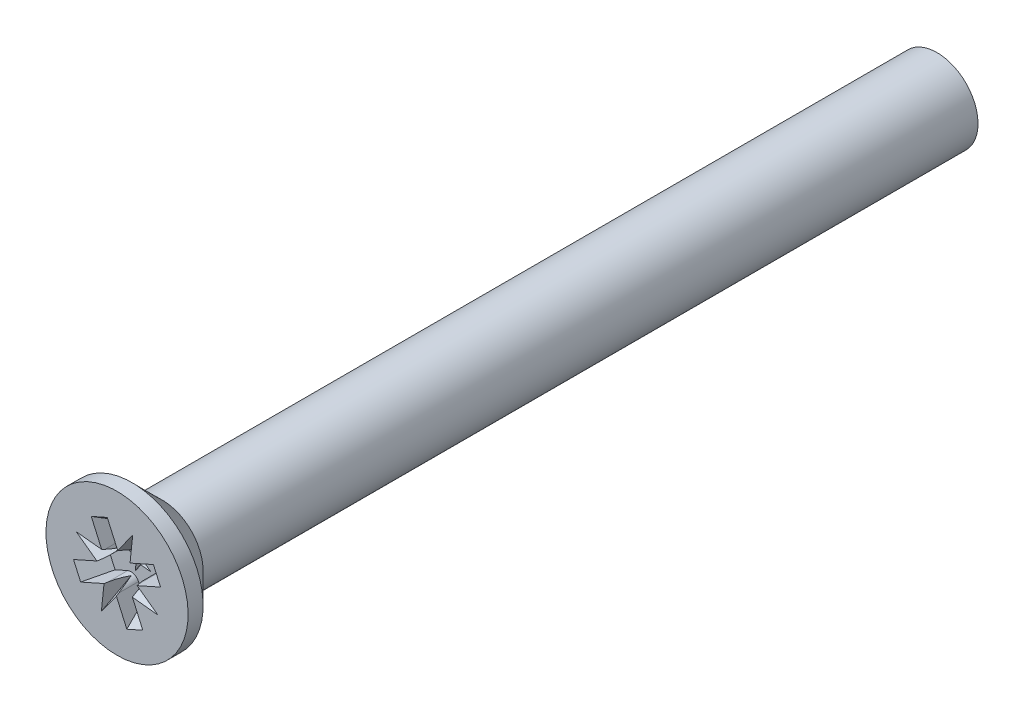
ISO-10303-21;
HEADER;
FILE_DESCRIPTION(('STEP AP214'),'2;1');
FILE_NAME('part.step','',(''),(''),'','','');
FILE_SCHEMA(('AUTOMOTIVE_DESIGN { 1 0 10303 214 1 1 1 1 }'));
ENDSEC;
DATA;
#1=APPLICATION_CONTEXT('core data for automotive mechanical design processes');
#2=APPLICATION_PROTOCOL_DEFINITION('international standard','automotive_design',2000,#1);
#3=PRODUCT_CONTEXT('',#1,'mechanical');
#4=PRODUCT('Part','Part','',(#3));
#5=PRODUCT_RELATED_PRODUCT_CATEGORY('part','',(#4));
#6=PRODUCT_DEFINITION_FORMATION('','',#4);
#7=PRODUCT_DEFINITION_CONTEXT('part definition',#1,'design');
#8=PRODUCT_DEFINITION('design','',#6,#7);
#9=PRODUCT_DEFINITION_SHAPE('','',#8);
#10=(LENGTH_UNIT() NAMED_UNIT(*) SI_UNIT(.MILLI.,.METRE.));
#11=(NAMED_UNIT(*) PLANE_ANGLE_UNIT() SI_UNIT($,.RADIAN.));
#12=(NAMED_UNIT(*) SI_UNIT($,.STERADIAN.) SOLID_ANGLE_UNIT());
#13=UNCERTAINTY_MEASURE_WITH_UNIT(LENGTH_MEASURE(1.E-05),#10,'distance_accuracy_value','');
#14=(GEOMETRIC_REPRESENTATION_CONTEXT(3) GLOBAL_UNCERTAINTY_ASSIGNED_CONTEXT((#13)) GLOBAL_UNIT_ASSIGNED_CONTEXT((#10,
#11,#12)) REPRESENTATION_CONTEXT('',''));
#15=CARTESIAN_POINT('',(0.,0.,0.));
#16=DIRECTION('',(0.,0.,1.));
#17=DIRECTION('',(1.,0.,0.));
#18=AXIS2_PLACEMENT_3D('',#15,#16,#17);
#19=CARTESIAN_POINT('',(0.702252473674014,-13.2440851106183,67.95));
#20=DIRECTION('',(-0.934548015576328,0.0981948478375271,-0.34202014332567));
#21=DIRECTION('',(-0.343681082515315,0.,0.939086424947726));
#22=AXIS2_PLACEMENT_3D('',#19,#20,#21);
#23=PLANE('',#22);
#24=DIRECTION('',(-0.353947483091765,-0.157601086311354,0.921891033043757));
#25=VECTOR('',#24,1.);
#26=CARTESIAN_POINT('',(1.13907958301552,-13.0495804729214,66.8122408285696));
#27=LINE('',#26,#25);
#28=CARTESIAN_POINT('',(1.13907958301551,-13.0495804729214,66.8122408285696));
#29=VERTEX_POINT('',#28);
#30=CARTESIAN_POINT('',(1.0189999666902,-13.1030479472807,67.125));
#31=VERTEX_POINT('',#30);
#32=EDGE_CURVE('E210',#29,#31,#27,.T.);
#33=ORIENTED_EDGE('',*,*,#32,.T.);
#34=DIRECTION('',(-0.104496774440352,-0.994525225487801,0.));
#35=VECTOR('',#34,1.);
#36=CARTESIAN_POINT('',(1.0189999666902,-13.1030479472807,67.125));
#37=LINE('',#36,#35);
#38=CARTESIAN_POINT('',(0.981473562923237,-13.4601972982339,67.125));
#39=VERTEX_POINT('',#38);
#40=EDGE_CURVE('E431',#31,#39,#37,.T.);
#41=ORIENTED_EDGE('',*,*,#40,.T.);
#42=DIRECTION('',(0.292031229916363,0.760839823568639,-0.579517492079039));
#43=VECTOR('',#42,1.);
#44=CARTESIAN_POINT('',(0.98147356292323,-13.4601972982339,67.125));
#45=LINE('',#44,#43);
#46=EDGE_CURVE('E398',#39,#29,#45,.T.);
#47=ORIENTED_EDGE('',*,*,#46,.T.);
#48=EDGE_LOOP('',(#33,#41,#47));
#49=FACE_BOUND('',#48,.T.);
#50=ADVANCED_FACE('F17',(#49),#23,.F.);
#51=CARTESIAN_POINT('',(1.33358422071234,-13.4864075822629,67.95));
#52=DIRECTION('',(0.760244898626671,-0.552313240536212,-0.34202014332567));
#53=DIRECTION('',(0.587759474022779,0.809035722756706,0.));
#54=AXIS2_PLACEMENT_3D('',#51,#52,#53);
#55=PLANE('',#54);
#56=ORIENTED_EDGE('',*,*,#46,.F.);
#57=DIRECTION('',(0.587759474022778,0.809035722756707,0.));
#58=VECTOR('',#57,1.);
#59=CARTESIAN_POINT('',(0.981473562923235,-13.4601972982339,67.125));
#60=LINE('',#59,#58);
#61=CARTESIAN_POINT('',(1.19254705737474,-13.1696600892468,67.125));
#62=VERTEX_POINT('',#61);
#63=EDGE_CURVE('E501',#39,#62,#60,.T.);
#64=ORIENTED_EDGE('',*,*,#63,.T.);
#65=DIRECTION('',(-0.157601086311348,0.353947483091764,-0.921891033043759));
#66=VECTOR('',#65,1.);
#67=CARTESIAN_POINT('',(1.19254705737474,-13.1696600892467,67.125));
#68=LINE('',#67,#66);
#69=EDGE_CURVE('E395',#62,#29,#68,.T.);
#70=ORIENTED_EDGE('',*,*,#69,.T.);
#71=EDGE_LOOP('',(#56,#64,#70));
#72=FACE_BOUND('',#71,.T.);
#73=ADVANCED_FACE('F720',(#72),#55,.F.);
#74=CARTESIAN_POINT('',(1.33358422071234,-13.4864075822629,67.95));
#75=DIRECTION('',(-0.0981948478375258,-0.934548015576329,-0.34202014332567));
#76=DIRECTION('',(0.,0.343681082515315,-0.939086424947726));
#77=AXIS2_PLACEMENT_3D('',#74,#75,#76);
#78=PLANE('',#77);
#79=ORIENTED_EDGE('',*,*,#69,.F.);
#80=DIRECTION('',(0.994525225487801,-0.104496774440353,0.));
#81=VECTOR('',#80,1.);
#82=CARTESIAN_POINT('',(1.19254705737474,-13.1696600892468,67.125));
#83=LINE('',#82,#81);
#84=CARTESIAN_POINT('',(1.54969640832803,-13.2071864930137,67.125));
#85=VERTEX_POINT('',#84);
#86=EDGE_CURVE('E499',#62,#85,#83,.T.);
#87=ORIENTED_EDGE('',*,*,#86,.T.);
#88=DIRECTION('',(-0.760839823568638,0.292031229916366,-0.579517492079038));
#89=VECTOR('',#88,1.);
#90=CARTESIAN_POINT('',(1.54969640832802,-13.2071864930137,67.125));
#91=LINE('',#90,#89);
#92=EDGE_CURVE('E392',#85,#29,#91,.T.);
#93=ORIENTED_EDGE('',*,*,#92,.T.);
#94=EDGE_LOOP('',(#79,#87,#93));
#95=FACE_BOUND('',#94,.T.);
#96=ADVANCED_FACE('F724',(#95),#78,.F.);
#97=CARTESIAN_POINT('',(1.57590669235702,-12.8550758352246,67.95));
#98=DIRECTION('',(0.552313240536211,0.760244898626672,-0.34202014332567));
#99=DIRECTION('',(-0.809035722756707,0.587759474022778,0.));
#100=AXIS2_PLACEMENT_3D('',#97,#98,#99);
#101=PLANE('',#100);
#102=ORIENTED_EDGE('',*,*,#92,.F.);
#103=DIRECTION('',(-0.809035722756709,0.587759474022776,0.));
#104=VECTOR('',#103,1.);
#105=CARTESIAN_POINT('',(1.54969640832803,-13.2071864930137,67.125));
#106=LINE('',#105,#104);
#107=CARTESIAN_POINT('',(1.25915919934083,-12.9961129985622,67.125));
#108=VERTEX_POINT('',#107);
#109=EDGE_CURVE('E497',#85,#108,#106,.T.);
#110=ORIENTED_EDGE('',*,*,#109,.T.);
#111=DIRECTION('',(-0.353947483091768,-0.157601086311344,-0.921891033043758));
#112=VECTOR('',#111,1.);
#113=CARTESIAN_POINT('',(1.25915919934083,-12.9961129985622,67.125));
#114=LINE('',#113,#112);
#115=EDGE_CURVE('E389',#108,#29,#114,.T.);
#116=ORIENTED_EDGE('',*,*,#115,.T.);
#117=EDGE_LOOP('',(#102,#110,#116));
#118=FACE_BOUND('',#117,.T.);
#119=ADVANCED_FACE('F728',(#118),#101,.F.);
#120=CARTESIAN_POINT('',(1.57590669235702,-12.8550758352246,67.95));
#121=DIRECTION('',(0.934548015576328,-0.0981948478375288,-0.342020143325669));
#122=DIRECTION('',(-0.343681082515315,0.,-0.939086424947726));
#123=AXIS2_PLACEMENT_3D('',#120,#121,#122);
#124=PLANE('',#123);
#125=ORIENTED_EDGE('',*,*,#115,.F.);
#126=DIRECTION('',(0.104496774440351,0.994525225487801,0.));
#127=VECTOR('',#126,1.);
#128=CARTESIAN_POINT('',(1.25915919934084,-12.9961129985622,67.125));
#129=LINE('',#128,#127);
#130=CARTESIAN_POINT('',(1.2966856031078,-12.6389636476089,67.125));
#131=VERTEX_POINT('',#130);
#132=EDGE_CURVE('E495',#108,#131,#129,.T.);
#133=ORIENTED_EDGE('',*,*,#132,.T.);
#134=DIRECTION('',(-0.292031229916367,-0.760839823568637,-0.57951749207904));
#135=VECTOR('',#134,1.);
#136=CARTESIAN_POINT('',(1.2966856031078,-12.6389636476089,67.125));
#137=LINE('',#136,#135);
#138=EDGE_CURVE('E386',#131,#29,#137,.T.);
#139=ORIENTED_EDGE('',*,*,#138,.T.);
#140=EDGE_LOOP('',(#125,#133,#139));
#141=FACE_BOUND('',#140,.T.);
#142=ADVANCED_FACE('F731',(#141),#124,.F.);
#143=CARTESIAN_POINT('',(0.944574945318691,-12.6127533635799,67.95));
#144=DIRECTION('',(-0.76024489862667,0.552313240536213,-0.342020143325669));
#145=DIRECTION('',(-0.58775947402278,-0.809035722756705,0.));
#146=AXIS2_PLACEMENT_3D('',#143,#144,#145);
#147=PLANE('',#146);
#148=ORIENTED_EDGE('',*,*,#138,.F.);
#149=DIRECTION('',(-0.587759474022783,-0.809035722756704,0.));
#150=VECTOR('',#149,1.);
#151=CARTESIAN_POINT('',(1.2966856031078,-12.6389636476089,67.125));
#152=LINE('',#151,#150);
#153=CARTESIAN_POINT('',(1.0856121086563,-12.9295008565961,67.125));
#154=VERTEX_POINT('',#153);
#155=EDGE_CURVE('E493',#131,#154,#152,.T.);
#156=ORIENTED_EDGE('',*,*,#155,.T.);
#157=DIRECTION('',(0.157601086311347,-0.353947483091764,-0.921891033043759));
#158=VECTOR('',#157,1.);
#159=CARTESIAN_POINT('',(1.08561210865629,-12.9295008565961,67.125));
#160=LINE('',#159,#158);
#161=EDGE_CURVE('E383',#154,#29,#160,.T.);
#162=ORIENTED_EDGE('',*,*,#161,.T.);
#163=EDGE_LOOP('',(#148,#156,#162));
#164=FACE_BOUND('',#163,.T.);
#165=ADVANCED_FACE('F733',(#164),#147,.F.);
#166=CARTESIAN_POINT('',(0.944574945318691,-12.6127533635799,67.95));
#167=DIRECTION('',(0.0981948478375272,0.934548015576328,-0.34202014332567));
#168=DIRECTION('',(0.,0.343681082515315,0.939086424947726));
#169=AXIS2_PLACEMENT_3D('',#166,#167,#168);
#170=PLANE('',#169);
#171=ORIENTED_EDGE('',*,*,#161,.F.);
#172=DIRECTION('',(-0.994525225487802,0.104496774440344,0.));
#173=VECTOR('',#172,1.);
#174=CARTESIAN_POINT('',(1.08561210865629,-12.9295008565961,67.125));
#175=LINE('',#174,#173);
#176=CARTESIAN_POINT('',(0.728462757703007,-12.8919744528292,67.125));
#177=VERTEX_POINT('',#176);
#178=EDGE_CURVE('E491',#154,#177,#175,.T.);
#179=ORIENTED_EDGE('',*,*,#178,.T.);
#180=DIRECTION('',(0.760839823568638,-0.292031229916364,-0.579517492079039));
#181=VECTOR('',#180,1.);
#182=CARTESIAN_POINT('',(0.728462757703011,-12.8919744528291,67.125));
#183=LINE('',#182,#181);
#184=EDGE_CURVE('E380',#177,#29,#183,.T.);
#185=ORIENTED_EDGE('',*,*,#184,.T.);
#186=EDGE_LOOP('',(#171,#179,#185));
#187=FACE_BOUND('',#186,.T.);
#188=ADVANCED_FACE('F712',(#187),#170,.F.);
#189=CARTESIAN_POINT('',(0.702252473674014,-13.2440851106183,67.95));
#190=DIRECTION('',(-0.552313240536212,-0.760244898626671,-0.34202014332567));
#191=DIRECTION('',(0.809035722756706,-0.587759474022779,0.));
#192=AXIS2_PLACEMENT_3D('',#189,#190,#191);
#193=PLANE('',#192);
#194=ORIENTED_EDGE('',*,*,#184,.F.);
#195=DIRECTION('',(0.809035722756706,-0.58775947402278,0.));
#196=VECTOR('',#195,1.);
#197=CARTESIAN_POINT('',(0.728462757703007,-12.8919744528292,67.125));
#198=LINE('',#197,#196);
#199=EDGE_CURVE('E429',#177,#31,#198,.T.);
#200=ORIENTED_EDGE('',*,*,#199,.T.);
#201=ORIENTED_EDGE('',*,*,#32,.F.);
#202=EDGE_LOOP('',(#194,#200,#201));
#203=FACE_BOUND('',#202,.T.);
#204=ADVANCED_FACE('F625',(#203),#193,.F.);
#205=CARTESIAN_POINT('',(0.320494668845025,-12.7353850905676,67.125));
#206=DIRECTION('',(0.,0.,-1.));
#207=DIRECTION('',(0.,1.,0.));
#208=AXIS2_PLACEMENT_3D('',#205,#206,#207);
#209=CYLINDRICAL_SURFACE('',#208,0.3);
#210=CARTESIAN_POINT('',(0.320494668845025,-12.7353850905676,67.4357416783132));
#211=DIRECTION('',(-0.552313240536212,-0.760244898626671,-0.34202014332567));
#212=DIRECTION('',(0.201025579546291,0.276706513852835,-0.939692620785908));
#213=AXIS2_PLACEMENT_3D('',#210,#211,#212);
#214=ELLIPSE('',#213,0.877141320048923,0.3);
#215=CARTESIAN_POINT('',(0.600572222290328,-12.8428865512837,67.22241183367));
#216=VERTEX_POINT('',#215);
#217=CARTESIAN_POINT('',(0.442524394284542,-13.0094448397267,67.8478632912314));
#218=VERTEX_POINT('',#217);
#219=EDGE_CURVE('E342',#216,#218,#214,.T.);
#220=ORIENTED_EDGE('',*,*,#219,.T.);
#221=DIRECTION('',(0.,0.,1.));
#222=VECTOR('',#221,1.);
#223=CARTESIAN_POINT('',(0.442524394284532,-13.0094448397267,67.125));
#224=LINE('',#223,#222);
#225=CARTESIAN_POINT('',(0.442524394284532,-13.0094448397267,67.125));
#226=VERTEX_POINT('',#225);
#227=EDGE_CURVE('E339',#226,#218,#224,.T.);
#228=ORIENTED_EDGE('',*,*,#227,.F.);
#229=CARTESIAN_POINT('',(0.320494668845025,-12.7353850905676,67.125));
#230=DIRECTION('',(0.,0.,-1.));
#231=DIRECTION('',(0.,1.,0.));
#232=AXIS2_PLACEMENT_3D('',#229,#230,#231);
#233=CIRCLE('',#232,0.3);
#234=CARTESIAN_POINT('',(0.594554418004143,-12.6133553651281,67.125));
#235=VERTEX_POINT('',#234);
#236=EDGE_CURVE('E209',#226,#235,#233,.F.);
#237=ORIENTED_EDGE('',*,*,#236,.T.);
#238=DIRECTION('',(0.,0.,1.));
#239=VECTOR('',#238,1.);
#240=CARTESIAN_POINT('',(0.594554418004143,-12.6133553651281,67.125));
#241=LINE('',#240,#239);
#242=CARTESIAN_POINT('',(0.594554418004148,-12.6133553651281,67.8478632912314));
#243=VERTEX_POINT('',#242);
#244=EDGE_CURVE('E299',#243,#235,#241,.F.);
#245=ORIENTED_EDGE('',*,*,#244,.F.);
#246=CARTESIAN_POINT('',(0.320494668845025,-12.7353850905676,67.4357416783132));
#247=DIRECTION('',(0.0981948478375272,0.934548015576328,-0.34202014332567));
#248=DIRECTION('',(-0.035740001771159,-0.340147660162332,-0.939692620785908));
#249=AXIS2_PLACEMENT_3D('',#246,#247,#248);
#250=ELLIPSE('',#249,0.877141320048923,0.3);
#251=EDGE_CURVE('E423',#243,#216,#250,.T.);
#252=ORIENTED_EDGE('',*,*,#251,.T.);
#253=EDGE_LOOP('',(#220,#228,#237,#245,#252));
#254=FACE_BOUND('',#253,.T.);
#255=ADVANCED_FACE('F436',(#254),#209,.T.);
#256=CARTESIAN_POINT('',(1.45327496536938,-12.2309955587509,67.125));
#257=DIRECTION('',(0.,0.,-1.));
#258=DIRECTION('',(0.,1.,0.));
#259=AXIS2_PLACEMENT_3D('',#256,#257,#258);
#260=CYLINDRICAL_SURFACE('',#259,0.3);
#261=CARTESIAN_POINT('',(1.45327496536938,-12.2309955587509,67.4357416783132));
#262=DIRECTION('',(-0.76024489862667,0.552313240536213,-0.342020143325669));
#263=DIRECTION('',(0.276706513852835,-0.201025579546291,-0.939692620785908));
#264=AXIS2_PLACEMENT_3D('',#261,#262,#263);
#265=ELLIPSE('',#264,0.877141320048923,0.3);
#266=CARTESIAN_POINT('',(1.34577350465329,-12.5110731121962,67.22241183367));
#267=VERTEX_POINT('',#266);
#268=CARTESIAN_POINT('',(1.17921521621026,-12.3530252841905,67.8478632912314));
#269=VERTEX_POINT('',#268);
#270=EDGE_CURVE('E280',#267,#269,#265,.T.);
#271=ORIENTED_EDGE('',*,*,#270,.T.);
#272=DIRECTION('',(0.,0.,1.));
#273=VECTOR('',#272,1.);
#274=CARTESIAN_POINT('',(1.17921521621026,-12.3530252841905,67.125));
#275=LINE('',#274,#273);
#276=CARTESIAN_POINT('',(1.17921521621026,-12.3530252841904,67.125));
#277=VERTEX_POINT('',#276);
#278=EDGE_CURVE('E277',#277,#269,#275,.T.);
#279=ORIENTED_EDGE('',*,*,#278,.F.);
#280=CARTESIAN_POINT('',(1.45327496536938,-12.2309955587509,67.125));
#281=DIRECTION('',(0.,0.,-1.));
#282=DIRECTION('',(0.,1.,0.));
#283=AXIS2_PLACEMENT_3D('',#280,#281,#282);
#284=CIRCLE('',#283,0.3);
#285=CARTESIAN_POINT('',(1.57530469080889,-12.5050553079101,67.125));
#286=VERTEX_POINT('',#285);
#287=EDGE_CURVE('E430',#277,#286,#284,.F.);
#288=ORIENTED_EDGE('',*,*,#287,.T.);
#289=DIRECTION('',(0.,0.,1.));
#290=VECTOR('',#289,1.);
#291=CARTESIAN_POINT('',(1.57530469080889,-12.5050553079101,67.125));
#292=LINE('',#291,#290);
#293=CARTESIAN_POINT('',(1.57530469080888,-12.5050553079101,67.8478632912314));
#294=VERTEX_POINT('',#293);
#295=EDGE_CURVE('E235',#294,#286,#292,.F.);
#296=ORIENTED_EDGE('',*,*,#295,.F.);
#297=CARTESIAN_POINT('',(1.45327496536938,-12.2309955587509,67.4357416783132));
#298=DIRECTION('',(0.934548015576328,-0.0981948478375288,-0.342020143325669));
#299=DIRECTION('',(-0.340147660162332,0.0357400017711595,-0.939692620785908));
#300=AXIS2_PLACEMENT_3D('',#297,#298,#299);
#301=ELLIPSE('',#300,0.877141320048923,0.3);
#302=EDGE_CURVE('E419',#294,#267,#301,.T.);
#303=ORIENTED_EDGE('',*,*,#302,.T.);
#304=EDGE_LOOP('',(#271,#279,#288,#296,#303));
#305=FACE_BOUND('',#304,.T.);
#306=ADVANCED_FACE('F616',(#305),#260,.T.);
#307=CARTESIAN_POINT('',(1.95766449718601,-13.3637758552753,67.125));
#308=DIRECTION('',(0.,0.,-1.));
#309=DIRECTION('',(0.,1.,0.));
#310=AXIS2_PLACEMENT_3D('',#307,#308,#309);
#311=CYLINDRICAL_SURFACE('',#310,0.3);
#312=CARTESIAN_POINT('',(1.95766449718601,-13.3637758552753,67.4357416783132));
#313=DIRECTION('',(0.552313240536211,0.760244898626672,-0.34202014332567));
#314=DIRECTION('',(-0.201025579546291,-0.276706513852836,-0.939692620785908));
#315=AXIS2_PLACEMENT_3D('',#312,#313,#314);
#316=ELLIPSE('',#315,0.877141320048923,0.3);
#317=CARTESIAN_POINT('',(1.67758694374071,-13.2562743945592,67.22241183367));
#318=VERTEX_POINT('',#317);
#319=CARTESIAN_POINT('',(1.8356347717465,-13.0897161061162,67.8478632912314));
#320=VERTEX_POINT('',#319);
#321=EDGE_CURVE('E215',#318,#320,#316,.T.);
#322=ORIENTED_EDGE('',*,*,#321,.T.);
#323=DIRECTION('',(0.,0.,1.));
#324=VECTOR('',#323,1.);
#325=CARTESIAN_POINT('',(1.8356347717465,-13.0897161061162,67.125));
#326=LINE('',#325,#324);
#327=CARTESIAN_POINT('',(1.8356347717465,-13.0897161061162,67.125));
#328=VERTEX_POINT('',#327);
#329=EDGE_CURVE('E212',#328,#320,#326,.T.);
#330=ORIENTED_EDGE('',*,*,#329,.F.);
#331=CARTESIAN_POINT('',(1.95766449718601,-13.3637758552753,67.125));
#332=DIRECTION('',(0.,0.,-1.));
#333=DIRECTION('',(0.,1.,0.));
#334=AXIS2_PLACEMENT_3D('',#331,#332,#333);
#335=CIRCLE('',#334,0.3);
#336=CARTESIAN_POINT('',(1.68360474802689,-13.4858055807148,67.125));
#337=VERTEX_POINT('',#336);
#338=EDGE_CURVE('E20',#328,#337,#335,.F.);
#339=ORIENTED_EDGE('',*,*,#338,.T.);
#340=DIRECTION('',(0.,0.,1.));
#341=VECTOR('',#340,1.);
#342=CARTESIAN_POINT('',(1.68360474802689,-13.4858055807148,67.125));
#343=LINE('',#342,#341);
#344=CARTESIAN_POINT('',(1.68360474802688,-13.4858055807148,67.8478632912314));
#345=VERTEX_POINT('',#344);
#346=EDGE_CURVE('E511',#345,#337,#343,.F.);
#347=ORIENTED_EDGE('',*,*,#346,.F.);
#348=CARTESIAN_POINT('',(1.95766449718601,-13.3637758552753,67.4357416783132));
#349=DIRECTION('',(-0.0981948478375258,-0.934548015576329,-0.34202014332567));
#350=DIRECTION('',(0.0357400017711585,0.340147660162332,-0.939692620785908));
#351=AXIS2_PLACEMENT_3D('',#348,#349,#350);
#352=ELLIPSE('',#351,0.877141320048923,0.3);
#353=EDGE_CURVE('E414',#345,#318,#352,.T.);
#354=ORIENTED_EDGE('',*,*,#353,.T.);
#355=EDGE_LOOP('',(#322,#330,#339,#347,#354));
#356=FACE_BOUND('',#355,.T.);
#357=ADVANCED_FACE('F213',(#356),#311,.T.);
#358=CARTESIAN_POINT('',(1.30124494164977,-12.6270850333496,67.125));
#359=DIRECTION('',(0.,0.,-1.));
#360=DIRECTION('',(0.,1.,0.));
#361=AXIS2_PLACEMENT_3D('',#358,#359,#360);
#362=PLANE('',#361);
#363=ORIENTED_EDGE('',*,*,#178,.F.);
#364=ORIENTED_EDGE('',*,*,#155,.F.);
#365=ORIENTED_EDGE('',*,*,#132,.F.);
#366=ORIENTED_EDGE('',*,*,#109,.F.);
#367=ORIENTED_EDGE('',*,*,#86,.F.);
#368=ORIENTED_EDGE('',*,*,#63,.F.);
#369=ORIENTED_EDGE('',*,*,#40,.F.);
#370=ORIENTED_EDGE('',*,*,#199,.F.);
#371=EDGE_LOOP('',(#363,#364,#365,#366,#367,#368,#369,#370));
#372=FACE_BOUND('',#371,.T.);
#373=DIRECTION('',(0.406765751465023,-0.913532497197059,0.));
#374=VECTOR('',#373,1.);
#375=CARTESIAN_POINT('',(1.30124494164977,-12.6270850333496,67.125));
#376=LINE('',#375,#374);
#377=CARTESIAN_POINT('',(0.974332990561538,-11.8928917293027,67.125));
#378=VERTEX_POINT('',#377);
#379=EDGE_CURVE('E281',#378,#277,#376,.T.);
#380=ORIENTED_EDGE('',*,*,#379,.F.);
#381=DIRECTION('',(0.913532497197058,0.406765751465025,0.));
#382=VECTOR('',#381,1.);
#383=CARTESIAN_POINT('',(0.389672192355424,-12.1532218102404,67.125));
#384=LINE('',#383,#382);
#385=CARTESIAN_POINT('',(0.389672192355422,-12.1532218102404,67.125));
#386=VERTEX_POINT('',#385);
#387=EDGE_CURVE('E297',#386,#378,#384,.T.);
#388=ORIENTED_EDGE('',*,*,#387,.F.);
#389=DIRECTION('',(-0.406765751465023,0.913532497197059,0.));
#390=VECTOR('',#389,1.);
#391=CARTESIAN_POINT('',(0.71658414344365,-12.8874151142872,67.125));
#392=LINE('',#391,#390);
#393=EDGE_CURVE('E307',#235,#386,#392,.T.);
#394=ORIENTED_EDGE('',*,*,#393,.F.);
#395=ORIENTED_EDGE('',*,*,#236,.F.);
#396=DIRECTION('',(0.913532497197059,0.406765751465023,0.));
#397=VECTOR('',#396,1.);
#398=CARTESIAN_POINT('',(0.71658414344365,-12.8874151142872,67.125));
#399=LINE('',#398,#397);
#400=CARTESIAN_POINT('',(-0.0176091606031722,-13.2143270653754,67.125));
#401=VERTEX_POINT('',#400);
#402=EDGE_CURVE('E343',#401,#226,#399,.T.);
#403=ORIENTED_EDGE('',*,*,#402,.F.);
#404=DIRECTION('',(-0.406765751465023,0.913532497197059,0.));
#405=VECTOR('',#404,1.);
#406=CARTESIAN_POINT('',(0.242720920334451,-13.7989878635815,67.125));
#407=LINE('',#406,#405);
#408=CARTESIAN_POINT('',(0.24272092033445,-13.7989878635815,67.125));
#409=VERTEX_POINT('',#408);
#410=EDGE_CURVE('E359',#409,#401,#407,.T.);
#411=ORIENTED_EDGE('',*,*,#410,.F.);
#412=DIRECTION('',(-0.913532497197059,-0.406765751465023,0.));
#413=VECTOR('',#412,1.);
#414=CARTESIAN_POINT('',(0.976914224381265,-13.4720759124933,67.125));
#415=LINE('',#414,#413);
#416=CARTESIAN_POINT('',(0.702854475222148,-13.5941056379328,67.125));
#417=VERTEX_POINT('',#416);
#418=EDGE_CURVE('E369',#417,#409,#415,.T.);
#419=ORIENTED_EDGE('',*,*,#418,.F.);
#420=CARTESIAN_POINT('',(0.824884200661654,-13.8681653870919,67.125));
#421=DIRECTION('',(0.,0.,-1.));
#422=DIRECTION('',(0.,1.,0.));
#423=AXIS2_PLACEMENT_3D('',#420,#421,#422);
#424=CIRCLE('',#423,0.3);
#425=CARTESIAN_POINT('',(1.09894394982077,-13.7461356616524,67.125));
#426=VERTEX_POINT('',#425);
#427=EDGE_CURVE('E372',#426,#417,#424,.F.);
#428=ORIENTED_EDGE('',*,*,#427,.F.);
#429=DIRECTION('',(-0.406765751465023,0.913532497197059,0.));
#430=VECTOR('',#429,1.);
#431=CARTESIAN_POINT('',(0.976914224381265,-13.4720759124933,67.125));
#432=LINE('',#431,#430);
#433=CARTESIAN_POINT('',(1.30382617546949,-14.2062692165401,67.125));
#434=VERTEX_POINT('',#433);
#435=EDGE_CURVE('E478',#434,#426,#432,.T.);
#436=ORIENTED_EDGE('',*,*,#435,.F.);
#437=DIRECTION('',(-0.913532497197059,-0.406765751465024,0.));
#438=VECTOR('',#437,1.);
#439=CARTESIAN_POINT('',(1.88848697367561,-13.9459391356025,67.125));
#440=LINE('',#439,#438);
#441=CARTESIAN_POINT('',(1.88848697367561,-13.9459391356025,67.125));
#442=VERTEX_POINT('',#441);
#443=EDGE_CURVE('E509',#442,#434,#440,.T.);
#444=ORIENTED_EDGE('',*,*,#443,.F.);
#445=DIRECTION('',(0.406765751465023,-0.913532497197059,0.));
#446=VECTOR('',#445,1.);
#447=CARTESIAN_POINT('',(1.56157502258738,-13.2117458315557,67.125));
#448=LINE('',#447,#446);
#449=EDGE_CURVE('E205',#337,#442,#448,.T.);
#450=ORIENTED_EDGE('',*,*,#449,.F.);
#451=ORIENTED_EDGE('',*,*,#338,.F.);
#452=DIRECTION('',(-0.913532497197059,-0.406765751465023,0.));
#453=VECTOR('',#452,1.);
#454=CARTESIAN_POINT('',(1.56157502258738,-13.2117458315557,67.125));
#455=LINE('',#454,#453);
#456=CARTESIAN_POINT('',(2.2957683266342,-12.8848338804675,67.125));
#457=VERTEX_POINT('',#456);
#458=EDGE_CURVE('E202',#457,#328,#455,.T.);
#459=ORIENTED_EDGE('',*,*,#458,.F.);
#460=DIRECTION('',(0.406765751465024,-0.913532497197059,0.));
#461=VECTOR('',#460,1.);
#462=CARTESIAN_POINT('',(2.03543824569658,-12.3001730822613,67.125));
#463=LINE('',#462,#461);
#464=CARTESIAN_POINT('',(2.03543824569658,-12.3001730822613,67.125));
#465=VERTEX_POINT('',#464);
#466=EDGE_CURVE('E233',#465,#457,#463,.T.);
#467=ORIENTED_EDGE('',*,*,#466,.F.);
#468=DIRECTION('',(0.913532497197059,0.406765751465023,0.));
#469=VECTOR('',#468,1.);
#470=CARTESIAN_POINT('',(1.30124494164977,-12.6270850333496,67.125));
#471=LINE('',#470,#469);
#472=EDGE_CURVE('E245',#286,#465,#471,.T.);
#473=ORIENTED_EDGE('',*,*,#472,.F.);
#474=ORIENTED_EDGE('',*,*,#287,.F.);
#475=EDGE_LOOP('',(#380,#388,#394,#395,#403,#411,#419,#428,#436,#444,#450,#451,#459,#467,#473,#474));
#476=FACE_BOUND('',#475,.T.);
#477=ADVANCED_FACE('F200',(#372,#476),#362,.F.);
#478=CARTESIAN_POINT('',(0.824884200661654,-13.8681653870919,67.125));
#479=DIRECTION('',(0.,0.,-1.));
#480=DIRECTION('',(0.,1.,0.));
#481=AXIS2_PLACEMENT_3D('',#478,#479,#480);
#482=CYLINDRICAL_SURFACE('',#481,0.3);
#483=CARTESIAN_POINT('',(0.824884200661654,-13.8681653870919,67.4357416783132));
#484=DIRECTION('',(-0.934548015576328,0.0981948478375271,-0.34202014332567));
#485=DIRECTION('',(0.340147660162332,-0.0357400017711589,-0.939692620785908));
#486=AXIS2_PLACEMENT_3D('',#483,#484,#485);
#487=ELLIPSE('',#486,0.877141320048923,0.3);
#488=CARTESIAN_POINT('',(0.702854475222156,-13.5941056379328,67.8478632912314));
#489=VERTEX_POINT('',#488);
#490=CARTESIAN_POINT('',(0.932385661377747,-13.5880878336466,67.22241183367));
#491=VERTEX_POINT('',#490);
#492=EDGE_CURVE('E407',#489,#491,#487,.T.);
#493=ORIENTED_EDGE('',*,*,#492,.T.);
#494=CARTESIAN_POINT('',(0.824884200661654,-13.8681653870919,67.4357416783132));
#495=DIRECTION('',(0.760244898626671,-0.552313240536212,-0.34202014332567));
#496=DIRECTION('',(-0.276706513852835,0.201025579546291,-0.939692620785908));
#497=AXIS2_PLACEMENT_3D('',#494,#495,#496);
#498=ELLIPSE('',#497,0.877141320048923,0.3);
#499=CARTESIAN_POINT('',(1.09894394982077,-13.7461356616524,67.8478632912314));
#500=VERTEX_POINT('',#499);
#501=EDGE_CURVE('E410',#491,#500,#498,.T.);
#502=ORIENTED_EDGE('',*,*,#501,.T.);
#503=DIRECTION('',(0.,0.,1.));
#504=VECTOR('',#503,1.);
#505=CARTESIAN_POINT('',(1.09894394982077,-13.7461356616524,67.125));
#506=LINE('',#505,#504);
#507=EDGE_CURVE('E413',#426,#500,#506,.T.);
#508=ORIENTED_EDGE('',*,*,#507,.F.);
#509=ORIENTED_EDGE('',*,*,#427,.T.);
#510=DIRECTION('',(0.,0.,1.));
#511=VECTOR('',#510,1.);
#512=CARTESIAN_POINT('',(0.702854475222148,-13.5941056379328,67.125));
#513=LINE('',#512,#511);
#514=EDGE_CURVE('E361',#489,#417,#513,.F.);
#515=ORIENTED_EDGE('',*,*,#514,.F.);
#516=EDGE_LOOP('',(#493,#502,#508,#509,#515));
#517=FACE_BOUND('',#516,.T.);
#518=ADVANCED_FACE('F695',(#517),#482,.T.);
#519=CARTESIAN_POINT('',(0.976914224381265,-13.4720759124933,67.125));
#520=DIRECTION('',(-0.406765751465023,0.913532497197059,0.));
#521=DIRECTION('',(-0.913532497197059,-0.406765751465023,0.));
#522=AXIS2_PLACEMENT_3D('',#519,#520,#521);
#523=PLANE('',#522);
#524=DIRECTION('',(0.353947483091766,0.157601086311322,-0.921891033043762));
#525=VECTOR('',#524,1.);
#526=CARTESIAN_POINT('',(0.66364047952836,-13.6115663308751,67.95));
#527=LINE('',#526,#525);
#528=CARTESIAN_POINT('',(0.66364047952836,-13.6115663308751,67.95));
#529=VERTEX_POINT('',#528);
#530=EDGE_CURVE('E409',#529,#489,#527,.T.);
#531=ORIENTED_EDGE('',*,*,#530,.T.);
#532=ORIENTED_EDGE('',*,*,#514,.T.);
#533=ORIENTED_EDGE('',*,*,#418,.T.);
#534=DIRECTION('',(0.456766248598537,0.203382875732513,-0.866025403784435));
#535=VECTOR('',#534,1.);
#536=CARTESIAN_POINT('',(-0.192407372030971,-13.9927360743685,67.95));
#537=LINE('',#536,#535);
#538=CARTESIAN_POINT('',(-0.19240737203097,-13.9927360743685,67.95));
#539=VERTEX_POINT('',#538);
#540=EDGE_CURVE('E356',#539,#409,#537,.T.);
#541=ORIENTED_EDGE('',*,*,#540,.F.);
#542=DIRECTION('',(-0.913532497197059,-0.406765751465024,0.));
#543=VECTOR('',#542,1.);
#544=CARTESIAN_POINT('',(0.66364047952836,-13.6115663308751,67.95));
#545=LINE('',#544,#543);
#546=EDGE_CURVE('E366',#529,#539,#545,.T.);
#547=ORIENTED_EDGE('',*,*,#546,.F.);
#548=EDGE_LOOP('',(#531,#532,#533,#541,#547));
#549=FACE_BOUND('',#548,.T.);
#550=ADVANCED_FACE('F691',(#549),#523,.T.);
#551=CARTESIAN_POINT('',(-0.452737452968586,-13.4080752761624,67.95));
#552=DIRECTION('',(0.791142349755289,0.352269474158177,0.500000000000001));
#553=DIRECTION('',(0.534245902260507,0.,-0.845329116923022));
#554=AXIS2_PLACEMENT_3D('',#551,#552,#553);
#555=PLANE('',#554);
#556=DIRECTION('',(-0.406765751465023,0.913532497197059,0.));
#557=VECTOR('',#556,1.);
#558=CARTESIAN_POINT('',(-0.192407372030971,-13.9927360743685,67.95));
#559=LINE('',#558,#557);
#560=CARTESIAN_POINT('',(-0.452737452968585,-13.4080752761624,67.95));
#561=VERTEX_POINT('',#560);
#562=EDGE_CURVE('E346',#539,#561,#559,.T.);
#563=ORIENTED_EDGE('',*,*,#562,.F.);
#564=ORIENTED_EDGE('',*,*,#540,.T.);
#565=ORIENTED_EDGE('',*,*,#410,.T.);
#566=DIRECTION('',(0.456766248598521,0.203382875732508,-0.866025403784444));
#567=VECTOR('',#566,1.);
#568=CARTESIAN_POINT('',(-0.452737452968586,-13.4080752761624,67.95));
#569=LINE('',#568,#567);
#570=EDGE_CURVE('E351',#561,#401,#569,.T.);
#571=ORIENTED_EDGE('',*,*,#570,.F.);
#572=EDGE_LOOP('',(#563,#564,#565,#571));
#573=FACE_BOUND('',#572,.T.);
#574=ADVANCED_FACE('F688',(#573),#555,.T.);
#575=CARTESIAN_POINT('',(0.71658414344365,-12.8874151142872,67.125));
#576=DIRECTION('',(0.406765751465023,-0.913532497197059,0.));
#577=DIRECTION('',(0.913532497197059,0.406765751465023,0.));
#578=AXIS2_PLACEMENT_3D('',#575,#576,#577);
#579=PLANE('',#578);
#580=DIRECTION('',(-0.353947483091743,-0.157601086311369,0.921891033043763));
#581=VECTOR('',#580,1.);
#582=CARTESIAN_POINT('',(0.442524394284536,-13.0094448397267,67.8478632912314));
#583=LINE('',#582,#581);
#584=CARTESIAN_POINT('',(0.403310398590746,-13.0269055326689,67.95));
#585=VERTEX_POINT('',#584);
#586=EDGE_CURVE('E425',#218,#585,#583,.T.);
#587=ORIENTED_EDGE('',*,*,#586,.T.);
#588=DIRECTION('',(0.913532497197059,0.406765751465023,0.));
#589=VECTOR('',#588,1.);
#590=CARTESIAN_POINT('',(-0.452737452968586,-13.4080752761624,67.95));
#591=LINE('',#590,#589);
#592=EDGE_CURVE('E336',#561,#585,#591,.T.);
#593=ORIENTED_EDGE('',*,*,#592,.F.);
#594=ORIENTED_EDGE('',*,*,#570,.T.);
#595=ORIENTED_EDGE('',*,*,#402,.T.);
#596=ORIENTED_EDGE('',*,*,#227,.T.);
#597=EDGE_LOOP('',(#587,#593,#594,#595,#596));
#598=FACE_BOUND('',#597,.T.);
#599=ADVANCED_FACE('F685',(#598),#579,.T.);
#600=CARTESIAN_POINT('',(0.702252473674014,-13.2440851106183,67.95));
#601=DIRECTION('',(-0.552313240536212,-0.760244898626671,-0.34202014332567));
#602=DIRECTION('',(0.809035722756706,-0.587759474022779,0.));
#603=AXIS2_PLACEMENT_3D('',#600,#601,#602);
#604=PLANE('',#603);
#605=DIRECTION('',(-0.809035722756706,0.587759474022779,0.));
#606=VECTOR('',#605,1.);
#607=CARTESIAN_POINT('',(0.403310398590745,-13.0269055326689,67.95));
#608=LINE('',#607,#606);
#609=CARTESIAN_POINT('',(-0.354667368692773,-12.4762393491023,67.95));
#610=VERTEX_POINT('',#609);
#611=EDGE_CURVE('E331',#585,#610,#608,.T.);
#612=ORIENTED_EDGE('',*,*,#611,.F.);
#613=ORIENTED_EDGE('',*,*,#586,.F.);
#614=ORIENTED_EDGE('',*,*,#219,.F.);
#615=DIRECTION('',(-0.760839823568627,0.292031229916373,0.579517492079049));
#616=VECTOR('',#615,1.);
#617=CARTESIAN_POINT('',(0.600572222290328,-12.8428865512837,67.22241183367));
#618=LINE('',#617,#616);
#619=EDGE_CURVE('E311',#216,#610,#618,.T.);
#620=ORIENTED_EDGE('',*,*,#619,.T.);
#621=EDGE_LOOP('',(#612,#613,#614,#620));
#622=FACE_BOUND('',#621,.T.);
#623=ADVANCED_FACE('F450',(#622),#604,.F.);
#624=CARTESIAN_POINT('',(0.944574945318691,-12.6127533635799,67.95));
#625=DIRECTION('',(0.0981948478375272,0.934548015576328,-0.34202014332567));
#626=DIRECTION('',(0.,0.343681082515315,0.939086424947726));
#627=AXIS2_PLACEMENT_3D('',#624,#625,#626);
#628=PLANE('',#627);
#629=ORIENTED_EDGE('',*,*,#251,.F.);
#630=DIRECTION('',(0.157601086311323,-0.353947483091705,-0.921891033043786));
#631=VECTOR('',#630,1.);
#632=CARTESIAN_POINT('',(0.577093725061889,-12.5741413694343,67.95));
#633=LINE('',#632,#631);
#634=CARTESIAN_POINT('',(0.577093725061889,-12.5741413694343,67.95));
#635=VERTEX_POINT('',#634);
#636=EDGE_CURVE('E310',#635,#243,#633,.T.);
#637=ORIENTED_EDGE('',*,*,#636,.F.);
#638=DIRECTION('',(0.994525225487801,-0.104496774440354,0.));
#639=VECTOR('',#638,1.);
#640=CARTESIAN_POINT('',(-0.354667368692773,-12.4762393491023,67.95));
#641=LINE('',#640,#639);
#642=EDGE_CURVE('E326',#610,#635,#641,.T.);
#643=ORIENTED_EDGE('',*,*,#642,.F.);
#644=ORIENTED_EDGE('',*,*,#619,.F.);
#645=EDGE_LOOP('',(#629,#637,#643,#644));
#646=FACE_BOUND('',#645,.T.);
#647=ADVANCED_FACE('F444',(#646),#628,.F.);
#648=CARTESIAN_POINT('',(0.71658414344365,-12.8874151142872,67.125));
#649=DIRECTION('',(0.913532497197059,0.406765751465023,0.));
#650=DIRECTION('',(-0.406765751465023,0.913532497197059,0.));
#651=AXIS2_PLACEMENT_3D('',#648,#649,#650);
#652=PLANE('',#651);
#653=ORIENTED_EDGE('',*,*,#636,.T.);
#654=ORIENTED_EDGE('',*,*,#244,.T.);
#655=ORIENTED_EDGE('',*,*,#393,.T.);
#656=DIRECTION('',(0.203382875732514,-0.456766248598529,-0.866025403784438));
#657=VECTOR('',#656,1.);
#658=CARTESIAN_POINT('',(0.19592398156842,-11.7180935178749,67.95));
#659=LINE('',#658,#657);
#660=CARTESIAN_POINT('',(0.19592398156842,-11.7180935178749,67.95));
#661=VERTEX_POINT('',#660);
#662=EDGE_CURVE('E294',#661,#386,#659,.T.);
#663=ORIENTED_EDGE('',*,*,#662,.F.);
#664=DIRECTION('',(-0.406765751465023,0.913532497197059,0.));
#665=VECTOR('',#664,1.);
#666=CARTESIAN_POINT('',(0.577093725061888,-12.5741413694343,67.95));
#667=LINE('',#666,#665);
#668=EDGE_CURVE('E304',#635,#661,#667,.T.);
#669=ORIENTED_EDGE('',*,*,#668,.F.);
#670=EDGE_LOOP('',(#653,#654,#655,#663,#669));
#671=FACE_BOUND('',#670,.T.);
#672=ADVANCED_FACE('F440',(#671),#652,.T.);
#673=CARTESIAN_POINT('',(0.19592398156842,-11.7180935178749,67.95));
#674=DIRECTION('',(0.352269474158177,-0.791142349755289,0.500000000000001));
#675=DIRECTION('',(0.,-0.534245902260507,-0.845329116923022));
#676=AXIS2_PLACEMENT_3D('',#673,#674,#675);
#677=PLANE('',#676);
#678=DIRECTION('',(0.913532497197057,0.406765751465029,0.));
#679=VECTOR('',#678,1.);
#680=CARTESIAN_POINT('',(0.19592398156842,-11.7180935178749,67.95));
#681=LINE('',#680,#679);
#682=CARTESIAN_POINT('',(0.780584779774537,-11.4577634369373,67.95));
#683=VERTEX_POINT('',#682);
#684=EDGE_CURVE('E284',#661,#683,#681,.T.);
#685=ORIENTED_EDGE('',*,*,#684,.F.);
#686=ORIENTED_EDGE('',*,*,#662,.T.);
#687=ORIENTED_EDGE('',*,*,#387,.T.);
#688=DIRECTION('',(0.20338287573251,-0.456766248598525,-0.866025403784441));
#689=VECTOR('',#688,1.);
#690=CARTESIAN_POINT('',(0.780584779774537,-11.4577634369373,67.95));
#691=LINE('',#690,#689);
#692=EDGE_CURVE('E289',#683,#378,#691,.T.);
#693=ORIENTED_EDGE('',*,*,#692,.F.);
#694=EDGE_LOOP('',(#685,#686,#687,#693));
#695=FACE_BOUND('',#694,.T.);
#696=ADVANCED_FACE('F603',(#695),#677,.T.);
#697=CARTESIAN_POINT('',(1.30124494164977,-12.6270850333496,67.125));
#698=DIRECTION('',(-0.913532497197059,-0.406765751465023,0.));
#699=DIRECTION('',(0.406765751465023,-0.913532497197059,0.));
#700=AXIS2_PLACEMENT_3D('',#697,#698,#699);
#701=PLANE('',#700);
#702=DIRECTION('',(-0.157601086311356,0.353947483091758,0.92189103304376));
#703=VECTOR('',#702,1.);
#704=CARTESIAN_POINT('',(1.17921521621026,-12.3530252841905,67.8478632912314));
#705=LINE('',#704,#703);
#706=CARTESIAN_POINT('',(1.16175452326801,-12.3138112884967,67.95));
#707=VERTEX_POINT('',#706);
#708=EDGE_CURVE('E421',#269,#707,#705,.T.);
#709=ORIENTED_EDGE('',*,*,#708,.T.);
#710=DIRECTION('',(0.406765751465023,-0.913532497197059,0.));
#711=VECTOR('',#710,1.);
#712=CARTESIAN_POINT('',(0.780584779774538,-11.4577634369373,67.95));
#713=LINE('',#712,#711);
#714=EDGE_CURVE('E274',#683,#707,#713,.T.);
#715=ORIENTED_EDGE('',*,*,#714,.F.);
#716=ORIENTED_EDGE('',*,*,#692,.T.);
#717=ORIENTED_EDGE('',*,*,#379,.T.);
#718=ORIENTED_EDGE('',*,*,#278,.T.);
#719=EDGE_LOOP('',(#709,#715,#716,#717,#718));
#720=FACE_BOUND('',#719,.T.);
#721=ADVANCED_FACE('F594',(#720),#701,.T.);
#722=CARTESIAN_POINT('',(0.944574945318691,-12.6127533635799,67.95));
#723=DIRECTION('',(-0.76024489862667,0.552313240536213,-0.342020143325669));
#724=DIRECTION('',(-0.58775947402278,-0.809035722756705,0.));
#725=AXIS2_PLACEMENT_3D('',#722,#723,#724);
#726=PLANE('',#725);
#727=DIRECTION('',(0.58775947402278,0.809035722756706,0.));
#728=VECTOR('',#727,1.);
#729=CARTESIAN_POINT('',(1.16175452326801,-12.3138112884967,67.95));
#730=LINE('',#729,#728);
#731=CARTESIAN_POINT('',(1.71242070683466,-11.5558335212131,67.95));
#732=VERTEX_POINT('',#731);
#733=EDGE_CURVE('E269',#707,#732,#730,.T.);
#734=ORIENTED_EDGE('',*,*,#733,.F.);
#735=ORIENTED_EDGE('',*,*,#708,.F.);
#736=ORIENTED_EDGE('',*,*,#270,.F.);
#737=DIRECTION('',(0.292031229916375,0.760839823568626,0.579517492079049));
#738=VECTOR('',#737,1.);
#739=CARTESIAN_POINT('',(1.34577350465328,-12.5110731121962,67.22241183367));
#740=LINE('',#739,#738);
#741=EDGE_CURVE('E249',#267,#732,#740,.T.);
#742=ORIENTED_EDGE('',*,*,#741,.T.);
#743=EDGE_LOOP('',(#734,#735,#736,#742));
#744=FACE_BOUND('',#743,.T.);
#745=ADVANCED_FACE('F598',(#744),#726,.F.);
#746=CARTESIAN_POINT('',(1.57590669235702,-12.8550758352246,67.95));
#747=DIRECTION('',(0.934548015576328,-0.0981948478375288,-0.342020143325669));
#748=DIRECTION('',(-0.343681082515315,0.,-0.939086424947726));
#749=AXIS2_PLACEMENT_3D('',#746,#747,#748);
#750=PLANE('',#749);
#751=ORIENTED_EDGE('',*,*,#302,.F.);
#752=DIRECTION('',(-0.353947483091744,-0.157601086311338,-0.921891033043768));
#753=VECTOR('',#752,1.);
#754=CARTESIAN_POINT('',(1.61451868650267,-12.4875946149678,67.95));
#755=LINE('',#754,#753);
#756=CARTESIAN_POINT('',(1.61451868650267,-12.4875946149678,67.95));
#757=VERTEX_POINT('',#756);
#758=EDGE_CURVE('E248',#757,#294,#755,.T.);
#759=ORIENTED_EDGE('',*,*,#758,.F.);
#760=DIRECTION('',(-0.104496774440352,-0.994525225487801,0.));
#761=VECTOR('',#760,1.);
#762=CARTESIAN_POINT('',(1.71242070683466,-11.5558335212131,67.95));
#763=LINE('',#762,#761);
#764=EDGE_CURVE('E264',#732,#757,#763,.T.);
#765=ORIENTED_EDGE('',*,*,#764,.F.);
#766=ORIENTED_EDGE('',*,*,#741,.F.);
#767=EDGE_LOOP('',(#751,#759,#765,#766));
#768=FACE_BOUND('',#767,.T.);
#769=ADVANCED_FACE('F613',(#768),#750,.F.);
#770=CARTESIAN_POINT('',(1.30124494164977,-12.6270850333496,67.125));
#771=DIRECTION('',(0.406765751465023,-0.913532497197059,0.));
#772=DIRECTION('',(0.913532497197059,0.406765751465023,0.));
#773=AXIS2_PLACEMENT_3D('',#770,#771,#772);
#774=PLANE('',#773);
#775=ORIENTED_EDGE('',*,*,#758,.T.);
#776=ORIENTED_EDGE('',*,*,#295,.T.);
#777=ORIENTED_EDGE('',*,*,#472,.T.);
#778=DIRECTION('',(-0.456766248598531,-0.20338287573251,-0.866025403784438));
#779=VECTOR('',#778,1.);
#780=CARTESIAN_POINT('',(2.470566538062,-12.1064248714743,67.95));
#781=LINE('',#780,#779);
#782=CARTESIAN_POINT('',(2.470566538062,-12.1064248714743,67.95));
#783=VERTEX_POINT('',#782);
#784=EDGE_CURVE('E223',#783,#465,#781,.T.);
#785=ORIENTED_EDGE('',*,*,#784,.F.);
#786=DIRECTION('',(0.91353249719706,0.406765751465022,0.));
#787=VECTOR('',#786,1.);
#788=CARTESIAN_POINT('',(1.61451868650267,-12.4875946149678,67.95));
#789=LINE('',#788,#787);
#790=EDGE_CURVE('E242',#757,#783,#789,.T.);
#791=ORIENTED_EDGE('',*,*,#790,.F.);
#792=EDGE_LOOP('',(#775,#776,#777,#785,#791));
#793=FACE_BOUND('',#792,.T.);
#794=ADVANCED_FACE('F608',(#793),#774,.T.);
#795=CARTESIAN_POINT('',(2.470566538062,-12.1064248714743,67.95));
#796=DIRECTION('',(-0.791142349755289,-0.352269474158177,0.500000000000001));
#797=DIRECTION('',(0.534245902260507,0.,0.845329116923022));
#798=AXIS2_PLACEMENT_3D('',#795,#796,#797);
#799=PLANE('',#798);
#800=DIRECTION('',(0.406765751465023,-0.913532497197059,0.));
#801=VECTOR('',#800,1.);
#802=CARTESIAN_POINT('',(2.470566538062,-12.1064248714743,67.95));
#803=LINE('',#802,#801);
#804=CARTESIAN_POINT('',(2.73089661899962,-12.6910856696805,67.95));
#805=VERTEX_POINT('',#804);
#806=EDGE_CURVE('E238',#783,#805,#803,.T.);
#807=ORIENTED_EDGE('',*,*,#806,.F.);
#808=ORIENTED_EDGE('',*,*,#784,.T.);
#809=ORIENTED_EDGE('',*,*,#466,.T.);
#810=DIRECTION('',(-0.456766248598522,-0.203382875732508,-0.866025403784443));
#811=VECTOR('',#810,1.);
#812=CARTESIAN_POINT('',(2.73089661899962,-12.6910856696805,67.95));
#813=LINE('',#812,#811);
#814=EDGE_CURVE('E221',#805,#457,#813,.T.);
#815=ORIENTED_EDGE('',*,*,#814,.F.);
#816=EDGE_LOOP('',(#807,#808,#809,#815));
#817=FACE_BOUND('',#816,.T.);
#818=ADVANCED_FACE('F611',(#817),#799,.T.);
#819=CARTESIAN_POINT('',(1.56157502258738,-13.2117458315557,67.125));
#820=DIRECTION('',(-0.406765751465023,0.913532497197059,0.));
#821=DIRECTION('',(-0.913532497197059,-0.406765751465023,0.));
#822=AXIS2_PLACEMENT_3D('',#819,#820,#821);
#823=PLANE('',#822);
#824=DIRECTION('',(0.353947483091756,0.157601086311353,0.921891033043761));
#825=VECTOR('',#824,1.);
#826=CARTESIAN_POINT('',(1.8356347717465,-13.0897161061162,67.8478632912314));
#827=LINE('',#826,#825);
#828=CARTESIAN_POINT('',(1.87484876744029,-13.0722554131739,67.95));
#829=VERTEX_POINT('',#828);
#830=EDGE_CURVE('E417',#320,#829,#827,.T.);
#831=ORIENTED_EDGE('',*,*,#830,.T.);
#832=DIRECTION('',(-0.913532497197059,-0.406765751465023,0.));
#833=VECTOR('',#832,1.);
#834=CARTESIAN_POINT('',(2.73089661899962,-12.6910856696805,67.95));
#835=LINE('',#834,#833);
#836=EDGE_CURVE('E241',#805,#829,#835,.T.);
#837=ORIENTED_EDGE('',*,*,#836,.F.);
#838=ORIENTED_EDGE('',*,*,#814,.T.);
#839=ORIENTED_EDGE('',*,*,#458,.T.);
#840=ORIENTED_EDGE('',*,*,#329,.T.);
#841=EDGE_LOOP('',(#831,#837,#838,#839,#840));
#842=FACE_BOUND('',#841,.T.);
#843=ADVANCED_FACE('F219',(#842),#823,.T.);
#844=CARTESIAN_POINT('',(1.57590669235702,-12.8550758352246,67.95));
#845=DIRECTION('',(0.552313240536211,0.760244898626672,-0.34202014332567));
#846=DIRECTION('',(-0.809035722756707,0.587759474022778,0.));
#847=AXIS2_PLACEMENT_3D('',#844,#845,#846);
#848=PLANE('',#847);
#849=DIRECTION('',(0.809035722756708,-0.587759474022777,0.));
#850=VECTOR('',#849,1.);
#851=CARTESIAN_POINT('',(1.87484876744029,-13.0722554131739,67.95));
#852=LINE('',#851,#850);
#853=CARTESIAN_POINT('',(2.63282653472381,-13.6229215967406,67.95));
#854=VERTEX_POINT('',#853);
#855=EDGE_CURVE('E539',#829,#854,#852,.T.);
#856=ORIENTED_EDGE('',*,*,#855,.F.);
#857=ORIENTED_EDGE('',*,*,#830,.F.);
#858=ORIENTED_EDGE('',*,*,#321,.F.);
#859=DIRECTION('',(0.760839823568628,-0.292031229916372,0.579517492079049));
#860=VECTOR('',#859,1.);
#861=CARTESIAN_POINT('',(1.6775869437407,-13.2562743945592,67.22241183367));
#862=LINE('',#861,#860);
#863=EDGE_CURVE('E416',#318,#854,#862,.T.);
#864=ORIENTED_EDGE('',*,*,#863,.T.);
#865=EDGE_LOOP('',(#856,#857,#858,#864));
#866=FACE_BOUND('',#865,.T.);
#867=ADVANCED_FACE('F553',(#866),#848,.F.);
#868=CARTESIAN_POINT('',(1.33358422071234,-13.4864075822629,67.95));
#869=DIRECTION('',(-0.0981948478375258,-0.934548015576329,-0.34202014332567));
#870=DIRECTION('',(0.,0.343681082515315,-0.939086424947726));
#871=AXIS2_PLACEMENT_3D('',#868,#869,#870);
#872=PLANE('',#871);
#873=ORIENTED_EDGE('',*,*,#353,.F.);
#874=DIRECTION('',(-0.157601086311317,0.353947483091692,-0.921891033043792));
#875=VECTOR('',#874,1.);
#876=CARTESIAN_POINT('',(1.70106544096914,-13.5250195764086,67.95));
#877=LINE('',#876,#875);
#878=CARTESIAN_POINT('',(1.70106544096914,-13.5250195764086,67.95));
#879=VERTEX_POINT('',#878);
#880=EDGE_CURVE('E520',#879,#345,#877,.T.);
#881=ORIENTED_EDGE('',*,*,#880,.F.);
#882=DIRECTION('',(-0.994525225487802,0.10449677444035,0.));
#883=VECTOR('',#882,1.);
#884=CARTESIAN_POINT('',(2.63282653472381,-13.6229215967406,67.95));
#885=LINE('',#884,#883);
#886=EDGE_CURVE('E534',#854,#879,#885,.T.);
#887=ORIENTED_EDGE('',*,*,#886,.F.);
#888=ORIENTED_EDGE('',*,*,#863,.F.);
#889=EDGE_LOOP('',(#873,#881,#887,#888));
#890=FACE_BOUND('',#889,.T.);
#891=ADVANCED_FACE('F558',(#890),#872,.F.);
#892=CARTESIAN_POINT('',(1.56157502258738,-13.2117458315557,67.125));
#893=DIRECTION('',(-0.913532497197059,-0.406765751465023,0.));
#894=DIRECTION('',(0.406765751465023,-0.913532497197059,0.));
#895=AXIS2_PLACEMENT_3D('',#892,#893,#894);
#896=PLANE('',#895);
#897=ORIENTED_EDGE('',*,*,#880,.T.);
#898=ORIENTED_EDGE('',*,*,#346,.T.);
#899=ORIENTED_EDGE('',*,*,#449,.T.);
#900=DIRECTION('',(-0.203382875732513,0.456766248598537,-0.866025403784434));
#901=VECTOR('',#900,1.);
#902=CARTESIAN_POINT('',(2.08223518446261,-14.3810674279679,67.95));
#903=LINE('',#902,#901);
#904=CARTESIAN_POINT('',(2.08223518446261,-14.3810674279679,67.95));
#905=VERTEX_POINT('',#904);
#906=EDGE_CURVE('E506',#905,#442,#903,.T.);
#907=ORIENTED_EDGE('',*,*,#906,.F.);
#908=DIRECTION('',(0.406765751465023,-0.913532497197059,0.));
#909=VECTOR('',#908,1.);
#910=CARTESIAN_POINT('',(1.70106544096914,-13.5250195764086,67.95));
#911=LINE('',#910,#909);
#912=EDGE_CURVE('E516',#879,#905,#911,.T.);
#913=ORIENTED_EDGE('',*,*,#912,.F.);
#914=EDGE_LOOP('',(#897,#898,#899,#907,#913));
#915=FACE_BOUND('',#914,.T.);
#916=ADVANCED_FACE('F564',(#915),#896,.T.);
#917=CARTESIAN_POINT('',(1.4975743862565,-14.6413975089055,67.95));
#918=DIRECTION('',(-0.352269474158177,0.791142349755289,0.500000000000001));
#919=DIRECTION('',(0.,-0.534245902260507,0.845329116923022));
#920=AXIS2_PLACEMENT_3D('',#917,#918,#919);
#921=PLANE('',#920);
#922=DIRECTION('',(-0.91353249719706,-0.406765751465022,0.));
#923=VECTOR('',#922,1.);
#924=CARTESIAN_POINT('',(2.08223518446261,-14.3810674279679,67.95));
#925=LINE('',#924,#923);
#926=CARTESIAN_POINT('',(1.49757438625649,-14.6413975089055,67.95));
#927=VERTEX_POINT('',#926);
#928=EDGE_CURVE('E481',#905,#927,#925,.T.);
#929=ORIENTED_EDGE('',*,*,#928,.F.);
#930=ORIENTED_EDGE('',*,*,#906,.T.);
#931=ORIENTED_EDGE('',*,*,#443,.T.);
#932=DIRECTION('',(-0.203382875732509,0.456766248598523,-0.866025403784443));
#933=VECTOR('',#932,1.);
#934=CARTESIAN_POINT('',(1.49757438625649,-14.6413975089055,67.95));
#935=LINE('',#934,#933);
#936=EDGE_CURVE('E486',#927,#434,#935,.T.);
#937=ORIENTED_EDGE('',*,*,#936,.F.);
#938=EDGE_LOOP('',(#929,#930,#931,#937));
#939=FACE_BOUND('',#938,.T.);
#940=ADVANCED_FACE('F566',(#939),#921,.T.);
#941=CARTESIAN_POINT('',(0.976914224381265,-13.4720759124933,67.125));
#942=DIRECTION('',(0.913532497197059,0.406765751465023,0.));
#943=DIRECTION('',(-0.406765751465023,0.913532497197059,0.));
#944=AXIS2_PLACEMENT_3D('',#941,#942,#943);
#945=PLANE('',#944);
#946=DIRECTION('',(0.157601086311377,-0.353947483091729,0.921891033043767));
#947=VECTOR('',#946,1.);
#948=CARTESIAN_POINT('',(1.09894394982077,-13.7461356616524,67.8478632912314));
#949=LINE('',#948,#947);
#950=CARTESIAN_POINT('',(1.11640464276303,-13.7853496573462,67.95));
#951=VERTEX_POINT('',#950);
#952=EDGE_CURVE('E412',#500,#951,#949,.T.);
#953=ORIENTED_EDGE('',*,*,#952,.T.);
#954=DIRECTION('',(-0.406765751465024,0.913532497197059,0.));
#955=VECTOR('',#954,1.);
#956=CARTESIAN_POINT('',(1.4975743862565,-14.6413975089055,67.95));
#957=LINE('',#956,#955);
#958=EDGE_CURVE('E467',#927,#951,#957,.T.);
#959=ORIENTED_EDGE('',*,*,#958,.F.);
#960=ORIENTED_EDGE('',*,*,#936,.T.);
#961=ORIENTED_EDGE('',*,*,#435,.T.);
#962=ORIENTED_EDGE('',*,*,#507,.T.);
#963=EDGE_LOOP('',(#953,#959,#960,#961,#962));
#964=FACE_BOUND('',#963,.T.);
#965=ADVANCED_FACE('F570',(#964),#945,.T.);
#966=CARTESIAN_POINT('',(1.33358422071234,-13.4864075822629,67.95));
#967=DIRECTION('',(0.760244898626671,-0.552313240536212,-0.34202014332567));
#968=DIRECTION('',(0.587759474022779,0.809035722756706,0.));
#969=AXIS2_PLACEMENT_3D('',#966,#967,#968);
#970=PLANE('',#969);
#971=DIRECTION('',(-0.587759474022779,-0.809035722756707,0.));
#972=VECTOR('',#971,1.);
#973=CARTESIAN_POINT('',(1.11640464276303,-13.7853496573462,67.95));
#974=LINE('',#973,#972);
#975=CARTESIAN_POINT('',(0.565738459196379,-14.5433274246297,67.95));
#976=VERTEX_POINT('',#975);
#977=EDGE_CURVE('E462',#951,#976,#974,.T.);
#978=ORIENTED_EDGE('',*,*,#977,.F.);
#979=ORIENTED_EDGE('',*,*,#952,.F.);
#980=ORIENTED_EDGE('',*,*,#501,.F.);
#981=DIRECTION('',(-0.292031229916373,-0.760839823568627,0.579517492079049));
#982=VECTOR('',#981,1.);
#983=CARTESIAN_POINT('',(0.932385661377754,-13.5880878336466,67.22241183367));
#984=LINE('',#983,#982);
#985=EDGE_CURVE('E35',#491,#976,#984,.T.);
#986=ORIENTED_EDGE('',*,*,#985,.T.);
#987=EDGE_LOOP('',(#978,#979,#980,#986));
#988=FACE_BOUND('',#987,.T.);
#989=ADVANCED_FACE('F572',(#988),#970,.F.);
#990=CARTESIAN_POINT('',(0.702252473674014,-13.2440851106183,67.95));
#991=DIRECTION('',(-0.934548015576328,0.0981948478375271,-0.34202014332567));
#992=DIRECTION('',(-0.343681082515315,0.,0.939086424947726));
#993=AXIS2_PLACEMENT_3D('',#990,#991,#992);
#994=PLANE('',#993);
#995=ORIENTED_EDGE('',*,*,#492,.F.);
#996=ORIENTED_EDGE('',*,*,#530,.F.);
#997=DIRECTION('',(0.104496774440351,0.994525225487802,0.));
#998=VECTOR('',#997,1.);
#999=CARTESIAN_POINT('',(0.565738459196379,-14.5433274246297,67.95));
#1000=LINE('',#999,#998);
#1001=EDGE_CURVE('E406',#976,#529,#1000,.T.);
#1002=ORIENTED_EDGE('',*,*,#1001,.F.);
#1003=ORIENTED_EDGE('',*,*,#985,.F.);
#1004=EDGE_LOOP('',(#995,#996,#1002,#1003));
#1005=FACE_BOUND('',#1004,.T.);
#1006=ADVANCED_FACE('F649',(#1005),#994,.F.);
#1007=CARTESIAN_POINT('',(0.0814886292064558,-10.6743959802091,67.95));
#1008=DIRECTION('',(0.,0.,1.));
#1009=DIRECTION('',(0.,-1.,0.));
#1010=AXIS2_PLACEMENT_3D('',#1007,#1008,#1009);
#1011=PLANE('',#1010);
#1012=ORIENTED_EDGE('',*,*,#977,.T.);
#1013=ORIENTED_EDGE('',*,*,#1001,.T.);
#1014=ORIENTED_EDGE('',*,*,#546,.T.);
#1015=ORIENTED_EDGE('',*,*,#562,.T.);
#1016=ORIENTED_EDGE('',*,*,#592,.T.);
#1017=ORIENTED_EDGE('',*,*,#611,.T.);
#1018=ORIENTED_EDGE('',*,*,#642,.T.);
#1019=ORIENTED_EDGE('',*,*,#668,.T.);
#1020=ORIENTED_EDGE('',*,*,#684,.T.);
#1021=ORIENTED_EDGE('',*,*,#714,.T.);
#1022=ORIENTED_EDGE('',*,*,#733,.T.);
#1023=ORIENTED_EDGE('',*,*,#764,.T.);
#1024=ORIENTED_EDGE('',*,*,#790,.T.);
#1025=ORIENTED_EDGE('',*,*,#806,.T.);
#1026=ORIENTED_EDGE('',*,*,#836,.T.);
#1027=ORIENTED_EDGE('',*,*,#855,.T.);
#1028=ORIENTED_EDGE('',*,*,#886,.T.);
#1029=ORIENTED_EDGE('',*,*,#912,.T.);
#1030=ORIENTED_EDGE('',*,*,#928,.T.);
#1031=ORIENTED_EDGE('',*,*,#958,.T.);
#1032=EDGE_LOOP('',(#1012,#1013,#1014,#1015,#1016,#1017,#1018,#1019,#1020,#1021,#1022,#1023,
#1024,#1025,#1026,#1027,#1028,#1029,#1030,#1031));
#1033=FACE_BOUND('',#1032,.T.);
#1034=CARTESIAN_POINT('',(1.13907958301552,-13.0495804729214,67.95));
#1035=DIRECTION('',(0.,0.,1.));
#1036=DIRECTION('',(0.,-1.,0.));
#1037=AXIS2_PLACEMENT_3D('',#1034,#1035,#1036);
#1038=CIRCLE('',#1037,2.6);
#1039=CARTESIAN_POINT('',(1.13907958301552,-15.6495804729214,67.95));
#1040=VERTEX_POINT('',#1039);
#1041=EDGE_CURVE('E403',#1040,#1040,#1038,.F.);
#1042=ORIENTED_EDGE('',*,*,#1041,.F.);
#1043=EDGE_LOOP('',(#1042));
#1044=FACE_BOUND('',#1043,.T.);
#1045=ADVANCED_FACE('F547',(#1033,#1044),#1011,.T.);
#1046=CARTESIAN_POINT('',(1.13907958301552,-13.0495804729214,63.4341870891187));
#1047=DIRECTION('',(0.,0.,1.));
#1048=DIRECTION('',(0.,-1.,0.));
#1049=AXIS2_PLACEMENT_3D('',#1046,#1047,#1048);
#1050=CYLINDRICAL_SURFACE('',#1049,2.6);
#1051=ORIENTED_EDGE('',*,*,#1041,.T.);
#1052=EDGE_LOOP('',(#1051));
#1053=FACE_BOUND('',#1052,.T.);
#1054=CARTESIAN_POINT('',(1.13907958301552,-13.0495804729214,67.4000000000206));
#1055=DIRECTION('',(0.,0.,1.));
#1056=DIRECTION('',(0.913532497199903,0.406765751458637,0.));
#1057=AXIS2_PLACEMENT_3D('',#1054,#1055,#1056);
#1058=CIRCLE('',#1057,2.60000000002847);
#1059=CARTESIAN_POINT('',(3.51426407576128,-11.9919895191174,67.4000000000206));
#1060=VERTEX_POINT('',#1059);
#1061=EDGE_CURVE('E402',#1060,#1060,#1058,.F.);
#1062=ORIENTED_EDGE('',*,*,#1061,.F.);
#1063=EDGE_LOOP('',(#1062));
#1064=FACE_BOUND('',#1063,.T.);
#1065=ADVANCED_FACE('F642',(#1053,#1064),#1050,.T.);
#1066=CARTESIAN_POINT('',(0.528930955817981,-11.6792817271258,37.95));
#1067=DIRECTION('',(0.,0.,-1.));
#1068=DIRECTION('',(0.,1.,0.));
#1069=AXIS2_PLACEMENT_3D('',#1066,#1067,#1068);
#1070=PLANE('',#1069);
#1071=CARTESIAN_POINT('',(1.13907958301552,-13.0495804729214,37.95));
#1072=DIRECTION('',(0.,0.,1.));
#1073=DIRECTION('',(0.,-1.,0.));
#1074=AXIS2_PLACEMENT_3D('',#1071,#1072,#1073);
#1075=CIRCLE('',#1074,1.5);
#1076=CARTESIAN_POINT('',(1.13907958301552,-14.5495804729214,37.95));
#1077=VERTEX_POINT('',#1076);
#1078=EDGE_CURVE('E26',#1077,#1077,#1075,.T.);
#1079=ORIENTED_EDGE('',*,*,#1078,.F.);
#1080=EDGE_LOOP('',(#1079));
#1081=FACE_BOUND('',#1080,.T.);
#1082=ADVANCED_FACE('F635',(#1081),#1070,.T.);
#1083=CARTESIAN_POINT('',(1.13907958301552,-13.0495804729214,67.4000000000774));
#1084=DIRECTION('',(0.,0.,1.));
#1085=DIRECTION('',(1.,0.,0.));
#1086=AXIS2_PLACEMENT_3D('',#1083,#1084,#1085);
#1087=CONICAL_SURFACE('',#1086,2.60000000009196,0.785398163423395);
#1088=CARTESIAN_POINT('',(1.13907958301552,-13.0495804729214,66.3));
#1089=DIRECTION('',(0.,0.,1.));
#1090=DIRECTION('',(0.,-1.,0.));
#1091=AXIS2_PLACEMENT_3D('',#1088,#1089,#1090);
#1092=CIRCLE('',#1091,1.5);
#1093=CARTESIAN_POINT('',(1.13907958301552,-14.5495804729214,66.3));
#1094=VERTEX_POINT('',#1093);
#1095=EDGE_CURVE('E11',#1094,#1094,#1092,.F.);
#1096=ORIENTED_EDGE('',*,*,#1095,.F.);
#1097=EDGE_LOOP('',(#1096));
#1098=FACE_BOUND('',#1097,.T.);
#1099=ORIENTED_EDGE('',*,*,#1061,.T.);
#1100=EDGE_LOOP('',(#1099));
#1101=FACE_BOUND('',#1100,.T.);
#1102=ADVANCED_FACE('F629',(#1098,#1101),#1087,.T.);
#1103=CARTESIAN_POINT('',(1.13907958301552,-13.0495804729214,63.4341870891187));
#1104=DIRECTION('',(0.,0.,1.));
#1105=DIRECTION('',(0.,-1.,0.));
#1106=AXIS2_PLACEMENT_3D('',#1103,#1104,#1105);
#1107=CYLINDRICAL_SURFACE('',#1106,1.5);
#1108=ORIENTED_EDGE('',*,*,#1078,.T.);
#1109=EDGE_LOOP('',(#1108));
#1110=FACE_BOUND('',#1109,.T.);
#1111=ORIENTED_EDGE('',*,*,#1095,.T.);
#1112=EDGE_LOOP('',(#1111));
#1113=FACE_BOUND('',#1112,.T.);
#1114=ADVANCED_FACE('F627',(#1110,#1113),#1107,.T.);
#1115=CLOSED_SHELL('',(#50,#73,#96,#119,#142,#165,#188,#204,#255,#306,#357,#477,#518,#550,#574,
#599,#623,#647,#672,#696,#721,#745,#769,#794,#818,#843,#867,#891,#916,#940,#965,#989,#1006,
#1045,#1065,#1082,#1102,#1114));
#1116=MANIFOLD_SOLID_BREP('B1',#1115);
#1117=ADVANCED_BREP_SHAPE_REPRESENTATION('',(#18,#1116),#14);
#1118=SHAPE_DEFINITION_REPRESENTATION(#9,#1117);
ENDSEC;
END-ISO-10303-21;
